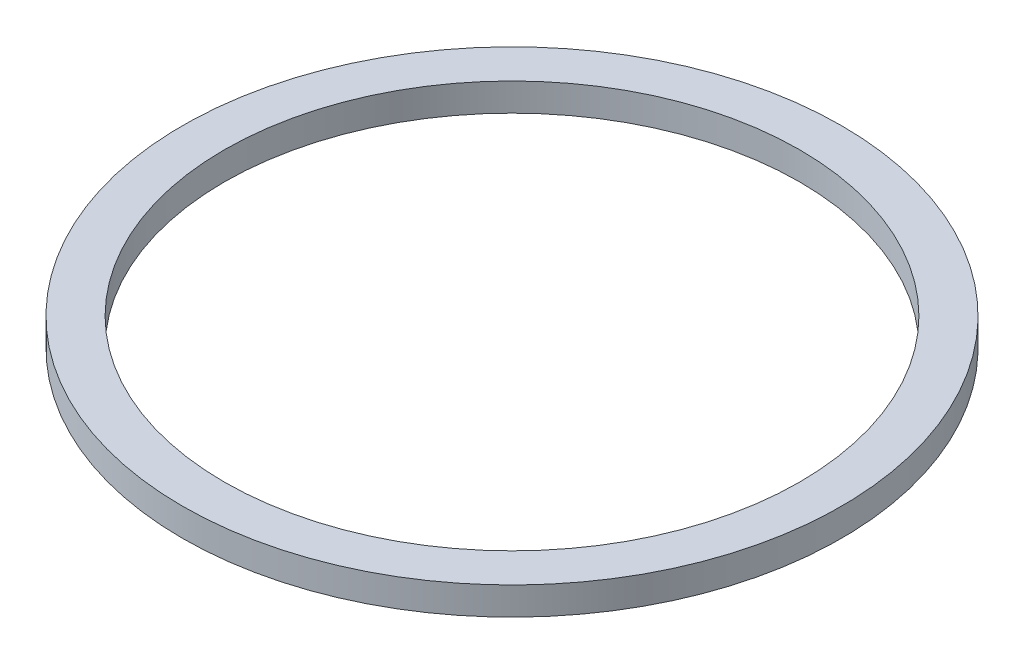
ISO-10303-21;
HEADER;
FILE_DESCRIPTION(('STEP AP214'),'2;1');
FILE_NAME('part.step','',(''),(''),'','','');
FILE_SCHEMA(('AUTOMOTIVE_DESIGN { 1 0 10303 214 1 1 1 1 }'));
ENDSEC;
DATA;
#1=APPLICATION_CONTEXT('core data for automotive mechanical design processes');
#2=APPLICATION_PROTOCOL_DEFINITION('international standard','automotive_design',2000,#1);
#3=PRODUCT_CONTEXT('',#1,'mechanical');
#4=PRODUCT('Part','Part','',(#3));
#5=PRODUCT_RELATED_PRODUCT_CATEGORY('part','',(#4));
#6=PRODUCT_DEFINITION_FORMATION('','',#4);
#7=PRODUCT_DEFINITION_CONTEXT('part definition',#1,'design');
#8=PRODUCT_DEFINITION('design','',#6,#7);
#9=PRODUCT_DEFINITION_SHAPE('','',#8);
#10=(LENGTH_UNIT() NAMED_UNIT(*) SI_UNIT(.MILLI.,.METRE.));
#11=(NAMED_UNIT(*) PLANE_ANGLE_UNIT() SI_UNIT($,.RADIAN.));
#12=(NAMED_UNIT(*) SI_UNIT($,.STERADIAN.) SOLID_ANGLE_UNIT());
#13=UNCERTAINTY_MEASURE_WITH_UNIT(LENGTH_MEASURE(1.E-05),#10,'distance_accuracy_value','');
#14=(GEOMETRIC_REPRESENTATION_CONTEXT(3) GLOBAL_UNCERTAINTY_ASSIGNED_CONTEXT((#13)) GLOBAL_UNIT_ASSIGNED_CONTEXT((#10,
#11,#12)) REPRESENTATION_CONTEXT('',''));
#15=CARTESIAN_POINT('',(0.,0.,0.));
#16=DIRECTION('',(0.,0.,1.));
#17=DIRECTION('',(1.,0.,0.));
#18=AXIS2_PLACEMENT_3D('',#15,#16,#17);
#19=CARTESIAN_POINT('',(0.,1.4,0.));
#20=DIRECTION('',(0.,1.,0.));
#21=DIRECTION('',(0.,0.,1.));
#22=AXIS2_PLACEMENT_3D('',#19,#20,#21);
#23=PLANE('',#22);
#24=CARTESIAN_POINT('',(0.,1.4,0.));
#25=DIRECTION('',(0.,1.,0.));
#26=DIRECTION('',(0.,0.,1.));
#27=AXIS2_PLACEMENT_3D('',#24,#25,#26);
#28=CIRCLE('',#27,16.55);
#29=CARTESIAN_POINT('',(0.,1.4,16.55));
#30=VERTEX_POINT('',#29);
#31=EDGE_CURVE('E10',#30,#30,#28,.T.);
#32=ORIENTED_EDGE('',*,*,#31,.T.);
#33=EDGE_LOOP('',(#32));
#34=FACE_BOUND('',#33,.T.);
#35=CARTESIAN_POINT('',(0.,1.4,0.));
#36=DIRECTION('',(0.,1.,0.));
#37=DIRECTION('',(0.,0.,1.));
#38=AXIS2_PLACEMENT_3D('',#35,#36,#37);
#39=CIRCLE('',#38,14.45);
#40=CARTESIAN_POINT('',(0.,1.4,14.45));
#41=VERTEX_POINT('',#40);
#42=EDGE_CURVE('E42',#41,#41,#39,.T.);
#43=ORIENTED_EDGE('',*,*,#42,.F.);
#44=EDGE_LOOP('',(#43));
#45=FACE_BOUND('',#44,.T.);
#46=ADVANCED_FACE('F31',(#34,#45),#23,.T.);
#47=CARTESIAN_POINT('',(0.,0.,0.));
#48=DIRECTION('',(0.,1.,0.));
#49=DIRECTION('',(0.,0.,1.));
#50=AXIS2_PLACEMENT_3D('',#47,#48,#49);
#51=PLANE('',#50);
#52=CARTESIAN_POINT('',(0.,0.,0.));
#53=DIRECTION('',(0.,1.,0.));
#54=DIRECTION('',(0.,0.,1.));
#55=AXIS2_PLACEMENT_3D('',#52,#53,#54);
#56=CIRCLE('',#55,16.55);
#57=CARTESIAN_POINT('',(0.,0.,16.55));
#58=VERTEX_POINT('',#57);
#59=EDGE_CURVE('E35',#58,#58,#56,.T.);
#60=ORIENTED_EDGE('',*,*,#59,.F.);
#61=EDGE_LOOP('',(#60));
#62=FACE_BOUND('',#61,.T.);
#63=CARTESIAN_POINT('',(0.,0.,0.));
#64=DIRECTION('',(0.,1.,0.));
#65=DIRECTION('',(0.,0.,1.));
#66=AXIS2_PLACEMENT_3D('',#63,#64,#65);
#67=CIRCLE('',#66,14.45);
#68=CARTESIAN_POINT('',(0.,0.,14.45));
#69=VERTEX_POINT('',#68);
#70=EDGE_CURVE('E44',#69,#69,#67,.T.);
#71=ORIENTED_EDGE('',*,*,#70,.T.);
#72=EDGE_LOOP('',(#71));
#73=FACE_BOUND('',#72,.T.);
#74=ADVANCED_FACE('F54',(#62,#73),#51,.F.);
#75=CARTESIAN_POINT('',(0.,1.4,0.));
#76=DIRECTION('',(0.,-1.,0.));
#77=DIRECTION('',(0.,0.,-1.));
#78=AXIS2_PLACEMENT_3D('',#75,#76,#77);
#79=CYLINDRICAL_SURFACE('',#78,16.55);
#80=ORIENTED_EDGE('',*,*,#31,.F.);
#81=EDGE_LOOP('',(#80));
#82=FACE_BOUND('',#81,.T.);
#83=ORIENTED_EDGE('',*,*,#59,.T.);
#84=EDGE_LOOP('',(#83));
#85=FACE_BOUND('',#84,.T.);
#86=ADVANCED_FACE('F33',(#82,#85),#79,.T.);
#87=CARTESIAN_POINT('',(0.,1.4,0.));
#88=DIRECTION('',(0.,-1.,0.));
#89=DIRECTION('',(0.,0.,-1.));
#90=AXIS2_PLACEMENT_3D('',#87,#88,#89);
#91=CYLINDRICAL_SURFACE('',#90,14.45);
#92=ORIENTED_EDGE('',*,*,#42,.T.);
#93=EDGE_LOOP('',(#92));
#94=FACE_BOUND('',#93,.T.);
#95=ORIENTED_EDGE('',*,*,#70,.F.);
#96=EDGE_LOOP('',(#95));
#97=FACE_BOUND('',#96,.T.);
#98=ADVANCED_FACE('F50',(#94,#97),#91,.F.);
#99=CLOSED_SHELL('',(#46,#74,#86,#98));
#100=MANIFOLD_SOLID_BREP('B2',#99);
#101=ADVANCED_BREP_SHAPE_REPRESENTATION('',(#18,#100),#14);
#102=SHAPE_DEFINITION_REPRESENTATION(#9,#101);
ENDSEC;
END-ISO-10303-21;
